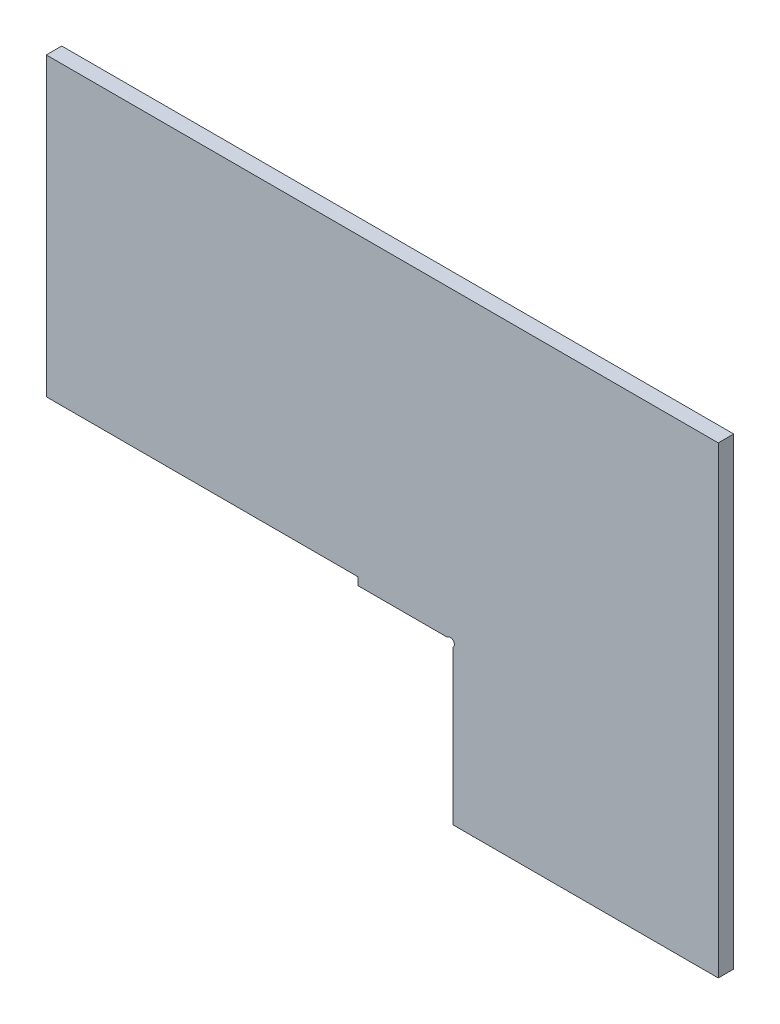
from build123d import *

# Parameters (mm, degrees)
EXTRUSION1_DEPTH        = 6
ESQUISSE3_W             = 37
ESQUISSE3_H             = 3
EXTRUSION2_DEPTH        = 6
ESQUISSE2_R             = 1.6
ENL_V_MAT_EXTRU_1_DEPTH = 6


with BuildPart() as part:
    # Esquisse1 → Extrusion1 (new body)
    with BuildSketch(Plane.XY):
        Polygon((-58.440456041, 127.912811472), (202.559543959, 127.912811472), (202.559543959, -52.087188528), (99.559543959, -52.087188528), (99.559543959, 12.912811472), (-58.440456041, 12.912811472), align=None)
    extrude(amount=EXTRUSION1_DEPTH)

    # Esquisse3 → Extrusion2 (add)
    with BuildSketch(Plane.XY.offset(6)):
        with Locations((81.059543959, 11.412811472)):
            Rectangle(ESQUISSE3_W, ESQUISSE3_H)
    extrude(amount=-EXTRUSION2_DEPTH)

    # Esquisse2 → Enl_v. mat.-Extru.1 (cut)
    with BuildSketch(Plane.XY.offset(6)):
        with Locations((98.459543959, 8.812811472)):
            Circle(ESQUISSE2_R)
    extrude(amount=-ENL_V_MAT_EXTRU_1_DEPTH, mode=Mode.SUBTRACT)


solid = part.part
